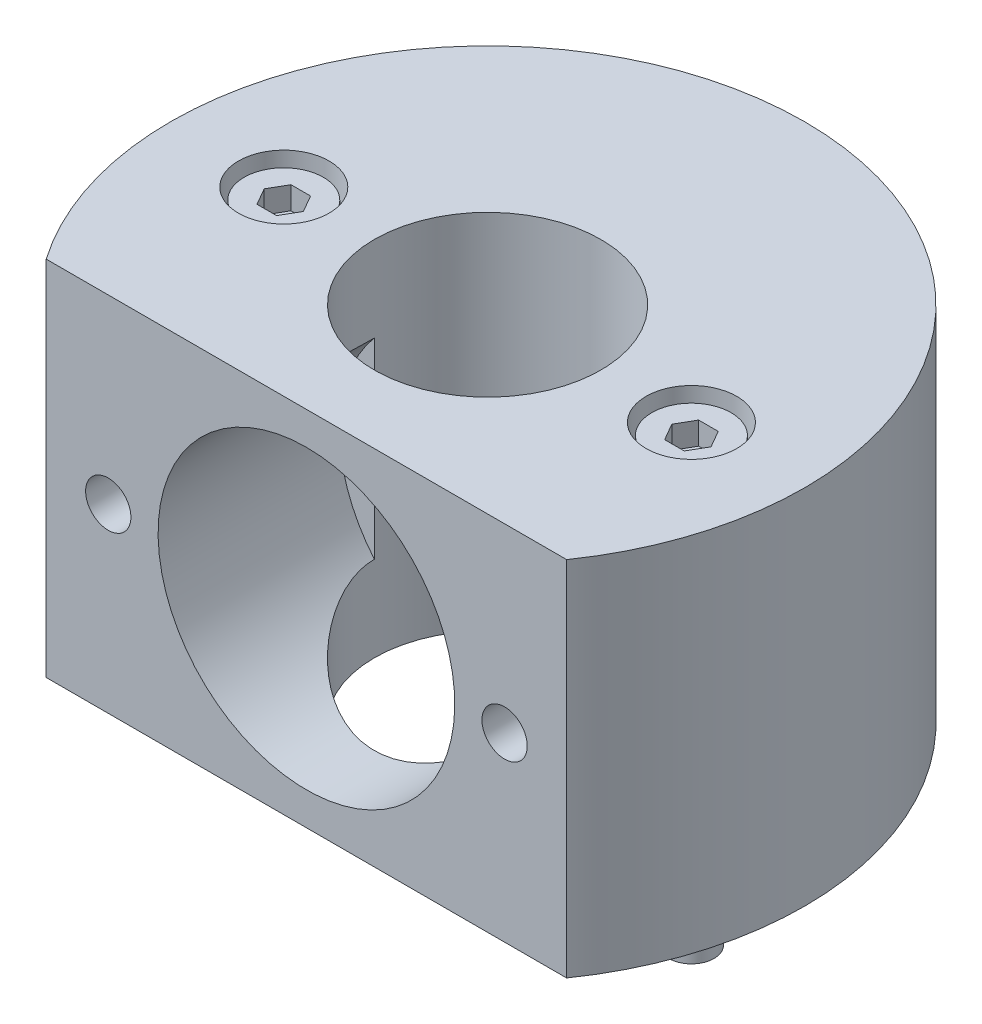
ISO-10303-21;
HEADER;
FILE_DESCRIPTION(('STEP AP214'),'2;1');
FILE_NAME('part.step','',(''),(''),'','','');
FILE_SCHEMA(('AUTOMOTIVE_DESIGN { 1 0 10303 214 1 1 1 1 }'));
ENDSEC;
DATA;
#1=APPLICATION_CONTEXT('core data for automotive mechanical design processes');
#2=APPLICATION_PROTOCOL_DEFINITION('international standard','automotive_design',2000,#1);
#3=PRODUCT_CONTEXT('',#1,'mechanical');
#4=PRODUCT('Part','Part','',(#3));
#5=PRODUCT_RELATED_PRODUCT_CATEGORY('part','',(#4));
#6=PRODUCT_DEFINITION_FORMATION('','',#4);
#7=PRODUCT_DEFINITION_CONTEXT('part definition',#1,'design');
#8=PRODUCT_DEFINITION('design','',#6,#7);
#9=PRODUCT_DEFINITION_SHAPE('','',#8);
#10=(LENGTH_UNIT() NAMED_UNIT(*) SI_UNIT(.MILLI.,.METRE.));
#11=(NAMED_UNIT(*) PLANE_ANGLE_UNIT() SI_UNIT($,.RADIAN.));
#12=(NAMED_UNIT(*) SI_UNIT($,.STERADIAN.) SOLID_ANGLE_UNIT());
#13=UNCERTAINTY_MEASURE_WITH_UNIT(LENGTH_MEASURE(1.E-05),#10,'distance_accuracy_value','');
#14=(GEOMETRIC_REPRESENTATION_CONTEXT(3) GLOBAL_UNCERTAINTY_ASSIGNED_CONTEXT((#13)) GLOBAL_UNIT_ASSIGNED_CONTEXT((#10,
#11,#12)) REPRESENTATION_CONTEXT('',''));
#15=CARTESIAN_POINT('',(0.,0.,0.));
#16=DIRECTION('',(0.,0.,1.));
#17=DIRECTION('',(1.,0.,0.));
#18=AXIS2_PLACEMENT_3D('',#15,#16,#17);
#19=CARTESIAN_POINT('',(-18.,-8.00000000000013,2.));
#20=DIRECTION('',(0.,-1.,0.));
#21=DIRECTION('',(0.,0.,-1.));
#22=AXIS2_PLACEMENT_3D('',#19,#20,#21);
#23=PLANE('',#22);
#24=CARTESIAN_POINT('',(-18.,-8.00000000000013,0.));
#25=DIRECTION('',(0.,1.,0.));
#26=DIRECTION('',(0.,0.,1.));
#27=AXIS2_PLACEMENT_3D('',#24,#25,#26);
#28=CIRCLE('',#27,2.);
#29=CARTESIAN_POINT('',(-18.,-8.00000000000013,2.));
#30=VERTEX_POINT('',#29);
#31=EDGE_CURVE('E339',#30,#30,#28,.T.);
#32=ORIENTED_EDGE('',*,*,#31,.F.);
#33=EDGE_LOOP('',(#32));
#34=FACE_BOUND('',#33,.T.);
#35=ADVANCED_FACE('F14',(#34),#23,.T.);
#36=CARTESIAN_POINT('',(-18.,11.9999999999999,0.));
#37=DIRECTION('',(0.,1.,0.));
#38=DIRECTION('',(0.,0.,1.));
#39=AXIS2_PLACEMENT_3D('',#36,#37,#38);
#40=CYLINDRICAL_SURFACE('',#39,2.);
#41=ORIENTED_EDGE('',*,*,#31,.T.);
#42=EDGE_LOOP('',(#41));
#43=FACE_BOUND('',#42,.T.);
#44=CARTESIAN_POINT('',(-18.,27.,0.));
#45=DIRECTION('',(0.,1.,0.));
#46=DIRECTION('',(0.,0.,1.));
#47=AXIS2_PLACEMENT_3D('',#44,#45,#46);
#48=CIRCLE('',#47,2.);
#49=CARTESIAN_POINT('',(-18.,27.,2.));
#50=VERTEX_POINT('',#49);
#51=EDGE_CURVE('E342',#50,#50,#48,.T.);
#52=ORIENTED_EDGE('',*,*,#51,.F.);
#53=EDGE_LOOP('',(#52));
#54=FACE_BOUND('',#53,.T.);
#55=ADVANCED_FACE('F258',(#43,#54),#40,.T.);
#56=CARTESIAN_POINT('',(-18.,27.,3.5));
#57=DIRECTION('',(0.,-1.,0.));
#58=DIRECTION('',(0.,0.,-1.));
#59=AXIS2_PLACEMENT_3D('',#56,#57,#58);
#60=PLANE('',#59);
#61=ORIENTED_EDGE('',*,*,#51,.T.);
#62=EDGE_LOOP('',(#61));
#63=FACE_BOUND('',#62,.T.);
#64=CARTESIAN_POINT('',(-18.,27.,0.));
#65=DIRECTION('',(0.,-1.,0.));
#66=DIRECTION('',(0.,0.,1.));
#67=AXIS2_PLACEMENT_3D('',#64,#65,#66);
#68=CIRCLE('',#67,2.25);
#69=CARTESIAN_POINT('',(-18.,27.,2.25));
#70=VERTEX_POINT('',#69);
#71=EDGE_CURVE('E9',#70,#70,#68,.T.);
#72=ORIENTED_EDGE('',*,*,#71,.T.);
#73=EDGE_LOOP('',(#72));
#74=FACE_BOUND('',#73,.T.);
#75=ADVANCED_FACE('F219',(#63,#74),#60,.T.);
#76=CARTESIAN_POINT('',(-16.2679491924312,29.,0.));
#77=DIRECTION('',(-0.86602540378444,0.,-0.5));
#78=DIRECTION('',(-0.5,0.,0.86602540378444));
#79=AXIS2_PLACEMENT_3D('',#76,#77,#78);
#80=PLANE('',#79);
#81=DIRECTION('',(0.,1.,0.));
#82=VECTOR('',#81,1.);
#83=CARTESIAN_POINT('',(-17.1339745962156,29.,1.5));
#84=LINE('',#83,#82);
#85=CARTESIAN_POINT('',(-17.1339745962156,29.,1.5));
#86=VERTEX_POINT('',#85);
#87=CARTESIAN_POINT('',(-17.1339745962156,31.,1.5));
#88=VERTEX_POINT('',#87);
#89=EDGE_CURVE('E337',#86,#88,#84,.T.);
#90=ORIENTED_EDGE('',*,*,#89,.T.);
#91=DIRECTION('',(-0.5,0.,0.86602540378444));
#92=VECTOR('',#91,1.);
#93=CARTESIAN_POINT('',(-16.2679491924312,31.,0.));
#94=LINE('',#93,#92);
#95=CARTESIAN_POINT('',(-16.2679491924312,31.,0.));
#96=VERTEX_POINT('',#95);
#97=EDGE_CURVE('E33',#96,#88,#94,.T.);
#98=ORIENTED_EDGE('',*,*,#97,.F.);
#99=DIRECTION('',(0.,1.,0.));
#100=VECTOR('',#99,1.);
#101=CARTESIAN_POINT('',(-16.2679491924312,29.,0.));
#102=LINE('',#101,#100);
#103=CARTESIAN_POINT('',(-16.2679491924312,29.,0.));
#104=VERTEX_POINT('',#103);
#105=EDGE_CURVE('E309',#104,#96,#102,.T.);
#106=ORIENTED_EDGE('',*,*,#105,.F.);
#107=DIRECTION('',(-0.5,0.,0.86602540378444));
#108=VECTOR('',#107,1.);
#109=CARTESIAN_POINT('',(-16.2679491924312,29.,0.));
#110=LINE('',#109,#108);
#111=EDGE_CURVE('E297',#104,#86,#110,.T.);
#112=ORIENTED_EDGE('',*,*,#111,.T.);
#113=EDGE_LOOP('',(#90,#98,#106,#112));
#114=FACE_BOUND('',#113,.T.);
#115=ADVANCED_FACE('F209',(#114),#80,.T.);
#116=CARTESIAN_POINT('',(-18.8660254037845,29.,1.5));
#117=DIRECTION('',(0.,0.,1.));
#118=DIRECTION('',(1.,0.,0.));
#119=AXIS2_PLACEMENT_3D('',#116,#117,#118);
#120=PLANE('',#119);
#121=DIRECTION('',(0.,1.,0.));
#122=VECTOR('',#121,1.);
#123=CARTESIAN_POINT('',(-18.8660254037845,29.,1.5));
#124=LINE('',#123,#122);
#125=CARTESIAN_POINT('',(-18.8660254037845,29.,1.5));
#126=VERTEX_POINT('',#125);
#127=CARTESIAN_POINT('',(-18.8660254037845,31.,1.5));
#128=VERTEX_POINT('',#127);
#129=EDGE_CURVE('E334',#126,#128,#124,.T.);
#130=ORIENTED_EDGE('',*,*,#129,.T.);
#131=DIRECTION('',(1.,0.,0.));
#132=VECTOR('',#131,1.);
#133=CARTESIAN_POINT('',(-18.8660254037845,31.,1.5));
#134=LINE('',#133,#132);
#135=EDGE_CURVE('E808',#128,#88,#134,.T.);
#136=ORIENTED_EDGE('',*,*,#135,.T.);
#137=ORIENTED_EDGE('',*,*,#89,.F.);
#138=DIRECTION('',(1.,0.,0.));
#139=VECTOR('',#138,1.);
#140=CARTESIAN_POINT('',(-18.8660254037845,29.,1.5));
#141=LINE('',#140,#139);
#142=EDGE_CURVE('E304',#126,#86,#141,.T.);
#143=ORIENTED_EDGE('',*,*,#142,.F.);
#144=EDGE_LOOP('',(#130,#136,#137,#143));
#145=FACE_BOUND('',#144,.T.);
#146=ADVANCED_FACE('F266',(#145),#120,.F.);
#147=CARTESIAN_POINT('',(-19.732050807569,29.,0.));
#148=DIRECTION('',(-0.86602540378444,0.,0.5));
#149=DIRECTION('',(0.5,0.,0.86602540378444));
#150=AXIS2_PLACEMENT_3D('',#147,#148,#149);
#151=PLANE('',#150);
#152=DIRECTION('',(0.,1.,0.));
#153=VECTOR('',#152,1.);
#154=CARTESIAN_POINT('',(-19.732050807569,29.,0.));
#155=LINE('',#154,#153);
#156=CARTESIAN_POINT('',(-19.732050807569,29.,0.));
#157=VERTEX_POINT('',#156);
#158=CARTESIAN_POINT('',(-19.732050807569,31.,0.));
#159=VERTEX_POINT('',#158);
#160=EDGE_CURVE('E331',#157,#159,#155,.T.);
#161=ORIENTED_EDGE('',*,*,#160,.T.);
#162=DIRECTION('',(0.5,0.,0.86602540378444));
#163=VECTOR('',#162,1.);
#164=CARTESIAN_POINT('',(-19.732050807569,31.,0.));
#165=LINE('',#164,#163);
#166=EDGE_CURVE('E812',#159,#128,#165,.T.);
#167=ORIENTED_EDGE('',*,*,#166,.T.);
#168=ORIENTED_EDGE('',*,*,#129,.F.);
#169=DIRECTION('',(0.5,0.,0.86602540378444));
#170=VECTOR('',#169,1.);
#171=CARTESIAN_POINT('',(-19.732050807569,29.,0.));
#172=LINE('',#171,#170);
#173=EDGE_CURVE('E324',#157,#126,#172,.T.);
#174=ORIENTED_EDGE('',*,*,#173,.F.);
#175=EDGE_LOOP('',(#161,#167,#168,#174));
#176=FACE_BOUND('',#175,.T.);
#177=ADVANCED_FACE('F269',(#176),#151,.F.);
#178=CARTESIAN_POINT('',(-19.732050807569,29.,0.));
#179=DIRECTION('',(0.86602540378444,0.,0.5));
#180=DIRECTION('',(0.5,0.,-0.86602540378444));
#181=AXIS2_PLACEMENT_3D('',#178,#179,#180);
#182=PLANE('',#181);
#183=DIRECTION('',(0.,1.,0.));
#184=VECTOR('',#183,1.);
#185=CARTESIAN_POINT('',(-18.8660254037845,29.,-1.5));
#186=LINE('',#185,#184);
#187=CARTESIAN_POINT('',(-18.8660254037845,29.,-1.5));
#188=VERTEX_POINT('',#187);
#189=CARTESIAN_POINT('',(-18.8660254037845,31.,-1.5));
#190=VERTEX_POINT('',#189);
#191=EDGE_CURVE('E328',#188,#190,#186,.T.);
#192=ORIENTED_EDGE('',*,*,#191,.T.);
#193=DIRECTION('',(0.5,0.,-0.86602540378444));
#194=VECTOR('',#193,1.);
#195=CARTESIAN_POINT('',(-19.732050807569,31.,0.));
#196=LINE('',#195,#194);
#197=EDGE_CURVE('E815',#159,#190,#196,.T.);
#198=ORIENTED_EDGE('',*,*,#197,.F.);
#199=ORIENTED_EDGE('',*,*,#160,.F.);
#200=DIRECTION('',(0.5,0.,-0.86602540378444));
#201=VECTOR('',#200,1.);
#202=CARTESIAN_POINT('',(-19.732050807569,29.,0.));
#203=LINE('',#202,#201);
#204=EDGE_CURVE('E317',#157,#188,#203,.T.);
#205=ORIENTED_EDGE('',*,*,#204,.T.);
#206=EDGE_LOOP('',(#192,#198,#199,#205));
#207=FACE_BOUND('',#206,.T.);
#208=ADVANCED_FACE('F273',(#207),#182,.T.);
#209=CARTESIAN_POINT('',(-17.1339745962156,29.,-1.5));
#210=DIRECTION('',(0.,0.,-1.));
#211=DIRECTION('',(-1.,0.,0.));
#212=AXIS2_PLACEMENT_3D('',#209,#210,#211);
#213=PLANE('',#212);
#214=DIRECTION('',(0.,1.,0.));
#215=VECTOR('',#214,1.);
#216=CARTESIAN_POINT('',(-17.1339745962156,29.,-1.5));
#217=LINE('',#216,#215);
#218=CARTESIAN_POINT('',(-17.1339745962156,29.,-1.5));
#219=VERTEX_POINT('',#218);
#220=CARTESIAN_POINT('',(-17.1339745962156,31.,-1.5));
#221=VERTEX_POINT('',#220);
#222=EDGE_CURVE('E312',#219,#221,#217,.T.);
#223=ORIENTED_EDGE('',*,*,#222,.T.);
#224=DIRECTION('',(-1.,0.,0.));
#225=VECTOR('',#224,1.);
#226=CARTESIAN_POINT('',(-17.1339745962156,31.,-1.5));
#227=LINE('',#226,#225);
#228=EDGE_CURVE('E820',#221,#190,#227,.T.);
#229=ORIENTED_EDGE('',*,*,#228,.T.);
#230=ORIENTED_EDGE('',*,*,#191,.F.);
#231=DIRECTION('',(-1.,0.,0.));
#232=VECTOR('',#231,1.);
#233=CARTESIAN_POINT('',(-17.1339745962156,29.,-1.5));
#234=LINE('',#233,#232);
#235=EDGE_CURVE('E314',#219,#188,#234,.T.);
#236=ORIENTED_EDGE('',*,*,#235,.F.);
#237=EDGE_LOOP('',(#223,#229,#230,#236));
#238=FACE_BOUND('',#237,.T.);
#239=ADVANCED_FACE('F277',(#238),#213,.F.);
#240=CARTESIAN_POINT('',(-16.2679491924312,29.,0.));
#241=DIRECTION('',(0.86602540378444,0.,-0.5));
#242=DIRECTION('',(-0.5,0.,-0.86602540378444));
#243=AXIS2_PLACEMENT_3D('',#240,#241,#242);
#244=PLANE('',#243);
#245=DIRECTION('',(-0.5,0.,-0.86602540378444));
#246=VECTOR('',#245,1.);
#247=CARTESIAN_POINT('',(-16.2679491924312,29.,0.));
#248=LINE('',#247,#246);
#249=EDGE_CURVE('E300',#104,#219,#248,.T.);
#250=ORIENTED_EDGE('',*,*,#249,.F.);
#251=ORIENTED_EDGE('',*,*,#105,.T.);
#252=DIRECTION('',(-0.5,0.,-0.86602540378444));
#253=VECTOR('',#252,1.);
#254=CARTESIAN_POINT('',(-16.2679491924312,31.,0.));
#255=LINE('',#254,#253);
#256=EDGE_CURVE('E305',#96,#221,#255,.T.);
#257=ORIENTED_EDGE('',*,*,#256,.T.);
#258=ORIENTED_EDGE('',*,*,#222,.F.);
#259=EDGE_LOOP('',(#250,#251,#257,#258));
#260=FACE_BOUND('',#259,.T.);
#261=ADVANCED_FACE('F252',(#260),#244,.F.);
#262=CARTESIAN_POINT('',(-17.1339745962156,29.,1.5));
#263=DIRECTION('',(0.,1.,0.));
#264=DIRECTION('',(0.,0.,1.));
#265=AXIS2_PLACEMENT_3D('',#262,#263,#264);
#266=PLANE('',#265);
#267=ORIENTED_EDGE('',*,*,#111,.F.);
#268=ORIENTED_EDGE('',*,*,#249,.T.);
#269=ORIENTED_EDGE('',*,*,#235,.T.);
#270=ORIENTED_EDGE('',*,*,#204,.F.);
#271=ORIENTED_EDGE('',*,*,#173,.T.);
#272=ORIENTED_EDGE('',*,*,#142,.T.);
#273=EDGE_LOOP('',(#267,#268,#269,#270,#271,#272));
#274=FACE_BOUND('',#273,.T.);
#275=ADVANCED_FACE('F250',(#274),#266,.T.);
#276=CARTESIAN_POINT('',(-18.,31.,0.));
#277=DIRECTION('',(0.,1.,0.));
#278=DIRECTION('',(0.,0.,1.));
#279=AXIS2_PLACEMENT_3D('',#276,#277,#278);
#280=PLANE('',#279);
#281=CARTESIAN_POINT('',(-18.,31.,0.));
#282=DIRECTION('',(0.,1.,0.));
#283=DIRECTION('',(0.,0.,1.));
#284=AXIS2_PLACEMENT_3D('',#281,#282,#283);
#285=CIRCLE('',#284,3.5);
#286=CARTESIAN_POINT('',(-18.,31.,3.5));
#287=VERTEX_POINT('',#286);
#288=EDGE_CURVE('E24',#287,#287,#285,.T.);
#289=ORIENTED_EDGE('',*,*,#288,.T.);
#290=EDGE_LOOP('',(#289));
#291=FACE_BOUND('',#290,.T.);
#292=ORIENTED_EDGE('',*,*,#256,.F.);
#293=ORIENTED_EDGE('',*,*,#97,.T.);
#294=ORIENTED_EDGE('',*,*,#135,.F.);
#295=ORIENTED_EDGE('',*,*,#166,.F.);
#296=ORIENTED_EDGE('',*,*,#197,.T.);
#297=ORIENTED_EDGE('',*,*,#228,.F.);
#298=EDGE_LOOP('',(#292,#293,#294,#295,#296,#297));
#299=FACE_BOUND('',#298,.T.);
#300=ADVANCED_FACE('F247',(#291,#299),#280,.T.);
#301=CARTESIAN_POINT('',(-18.,11.9999999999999,0.));
#302=DIRECTION('',(0.,1.,0.));
#303=DIRECTION('',(0.,0.,1.));
#304=AXIS2_PLACEMENT_3D('',#301,#302,#303);
#305=CYLINDRICAL_SURFACE('',#304,3.5);
#306=CARTESIAN_POINT('',(-18.,27.,0.));
#307=DIRECTION('',(0.,1.,0.));
#308=DIRECTION('',(0.,0.,1.));
#309=AXIS2_PLACEMENT_3D('',#306,#307,#308);
#310=CIRCLE('',#309,3.5);
#311=CARTESIAN_POINT('',(-18.,27.,3.5));
#312=VERTEX_POINT('',#311);
#313=EDGE_CURVE('E345',#312,#312,#310,.T.);
#314=ORIENTED_EDGE('',*,*,#313,.T.);
#315=EDGE_LOOP('',(#314));
#316=FACE_BOUND('',#315,.T.);
#317=ORIENTED_EDGE('',*,*,#288,.F.);
#318=EDGE_LOOP('',(#317));
#319=FACE_BOUND('',#318,.T.);
#320=ADVANCED_FACE('F245',(#316,#319),#305,.T.);
#321=CARTESIAN_POINT('',(18.8660254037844,29.,1.5));
#322=DIRECTION('',(0.,1.,0.));
#323=DIRECTION('',(0.,0.,1.));
#324=AXIS2_PLACEMENT_3D('',#321,#322,#323);
#325=PLANE('',#324);
#326=DIRECTION('',(-0.5,0.,0.86602540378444));
#327=VECTOR('',#326,1.);
#328=CARTESIAN_POINT('',(19.7320508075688,29.,0.));
#329=LINE('',#328,#327);
#330=CARTESIAN_POINT('',(19.7320508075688,29.,0.));
#331=VERTEX_POINT('',#330);
#332=CARTESIAN_POINT('',(18.8660254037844,29.,1.5));
#333=VERTEX_POINT('',#332);
#334=EDGE_CURVE('E353',#331,#333,#329,.T.);
#335=ORIENTED_EDGE('',*,*,#334,.F.);
#336=DIRECTION('',(-0.5,0.,-0.86602540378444));
#337=VECTOR('',#336,1.);
#338=CARTESIAN_POINT('',(19.7320508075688,29.,0.));
#339=LINE('',#338,#337);
#340=CARTESIAN_POINT('',(18.8660254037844,29.,-1.5));
#341=VERTEX_POINT('',#340);
#342=EDGE_CURVE('E369',#331,#341,#339,.T.);
#343=ORIENTED_EDGE('',*,*,#342,.T.);
#344=DIRECTION('',(-1.,0.,0.));
#345=VECTOR('',#344,1.);
#346=CARTESIAN_POINT('',(18.8660254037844,29.,-1.5));
#347=LINE('',#346,#345);
#348=CARTESIAN_POINT('',(17.1339745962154,29.,-1.5));
#349=VERTEX_POINT('',#348);
#350=EDGE_CURVE('E373',#341,#349,#347,.T.);
#351=ORIENTED_EDGE('',*,*,#350,.T.);
#352=DIRECTION('',(0.5,0.,-0.86602540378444));
#353=VECTOR('',#352,1.);
#354=CARTESIAN_POINT('',(16.267949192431,29.,0.));
#355=LINE('',#354,#353);
#356=CARTESIAN_POINT('',(16.267949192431,29.,0.));
#357=VERTEX_POINT('',#356);
#358=EDGE_CURVE('E376',#357,#349,#355,.T.);
#359=ORIENTED_EDGE('',*,*,#358,.F.);
#360=DIRECTION('',(0.5,0.,0.86602540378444));
#361=VECTOR('',#360,1.);
#362=CARTESIAN_POINT('',(16.267949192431,29.,0.));
#363=LINE('',#362,#361);
#364=CARTESIAN_POINT('',(17.1339745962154,29.,1.5));
#365=VERTEX_POINT('',#364);
#366=EDGE_CURVE('E379',#357,#365,#363,.T.);
#367=ORIENTED_EDGE('',*,*,#366,.T.);
#368=DIRECTION('',(1.,0.,0.));
#369=VECTOR('',#368,1.);
#370=CARTESIAN_POINT('',(17.1339745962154,29.,1.5));
#371=LINE('',#370,#369);
#372=EDGE_CURVE('E382',#365,#333,#371,.T.);
#373=ORIENTED_EDGE('',*,*,#372,.T.);
#374=EDGE_LOOP('',(#335,#343,#351,#359,#367,#373));
#375=FACE_BOUND('',#374,.T.);
#376=ADVANCED_FACE('F235',(#375),#325,.T.);
#377=CARTESIAN_POINT('',(18.8660254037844,29.,-1.5));
#378=DIRECTION('',(0.,0.,-1.));
#379=DIRECTION('',(-1.,0.,0.));
#380=AXIS2_PLACEMENT_3D('',#377,#378,#379);
#381=PLANE('',#380);
#382=DIRECTION('',(0.,1.,0.));
#383=VECTOR('',#382,1.);
#384=CARTESIAN_POINT('',(18.8660254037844,29.,-1.5));
#385=LINE('',#384,#383);
#386=CARTESIAN_POINT('',(18.8660254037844,31.,-1.5));
#387=VERTEX_POINT('',#386);
#388=EDGE_CURVE('E389',#341,#387,#385,.T.);
#389=ORIENTED_EDGE('',*,*,#388,.T.);
#390=DIRECTION('',(-1.,0.,0.));
#391=VECTOR('',#390,1.);
#392=CARTESIAN_POINT('',(18.8660254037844,31.,-1.5));
#393=LINE('',#392,#391);
#394=CARTESIAN_POINT('',(17.1339745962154,31.,-1.5));
#395=VERTEX_POINT('',#394);
#396=EDGE_CURVE('E354',#387,#395,#393,.T.);
#397=ORIENTED_EDGE('',*,*,#396,.T.);
#398=DIRECTION('',(0.,1.,0.));
#399=VECTOR('',#398,1.);
#400=CARTESIAN_POINT('',(17.1339745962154,29.,-1.5));
#401=LINE('',#400,#399);
#402=EDGE_CURVE('E391',#349,#395,#401,.T.);
#403=ORIENTED_EDGE('',*,*,#402,.F.);
#404=ORIENTED_EDGE('',*,*,#350,.F.);
#405=EDGE_LOOP('',(#389,#397,#403,#404));
#406=FACE_BOUND('',#405,.T.);
#407=ADVANCED_FACE('F231',(#406),#381,.F.);
#408=CARTESIAN_POINT('',(16.267949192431,29.,0.));
#409=DIRECTION('',(0.86602540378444,0.,0.5));
#410=DIRECTION('',(0.5,0.,-0.86602540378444));
#411=AXIS2_PLACEMENT_3D('',#408,#409,#410);
#412=PLANE('',#411);
#413=ORIENTED_EDGE('',*,*,#402,.T.);
#414=DIRECTION('',(0.5,0.,-0.86602540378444));
#415=VECTOR('',#414,1.);
#416=CARTESIAN_POINT('',(16.267949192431,31.,0.));
#417=LINE('',#416,#415);
#418=CARTESIAN_POINT('',(16.267949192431,31.,0.));
#419=VERTEX_POINT('',#418);
#420=EDGE_CURVE('E357',#419,#395,#417,.T.);
#421=ORIENTED_EDGE('',*,*,#420,.F.);
#422=DIRECTION('',(0.,1.,0.));
#423=VECTOR('',#422,1.);
#424=CARTESIAN_POINT('',(16.267949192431,29.,0.));
#425=LINE('',#424,#423);
#426=EDGE_CURVE('E393',#357,#419,#425,.T.);
#427=ORIENTED_EDGE('',*,*,#426,.F.);
#428=ORIENTED_EDGE('',*,*,#358,.T.);
#429=EDGE_LOOP('',(#413,#421,#427,#428));
#430=FACE_BOUND('',#429,.T.);
#431=ADVANCED_FACE('F227',(#430),#412,.T.);
#432=CARTESIAN_POINT('',(16.267949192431,29.,0.));
#433=DIRECTION('',(-0.86602540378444,0.,0.5));
#434=DIRECTION('',(0.5,0.,0.86602540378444));
#435=AXIS2_PLACEMENT_3D('',#432,#433,#434);
#436=PLANE('',#435);
#437=ORIENTED_EDGE('',*,*,#426,.T.);
#438=DIRECTION('',(0.5,0.,0.86602540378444));
#439=VECTOR('',#438,1.);
#440=CARTESIAN_POINT('',(16.267949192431,31.,0.));
#441=LINE('',#440,#439);
#442=CARTESIAN_POINT('',(17.1339745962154,31.,1.5));
#443=VERTEX_POINT('',#442);
#444=EDGE_CURVE('E360',#419,#443,#441,.T.);
#445=ORIENTED_EDGE('',*,*,#444,.T.);
#446=DIRECTION('',(0.,1.,0.));
#447=VECTOR('',#446,1.);
#448=CARTESIAN_POINT('',(17.1339745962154,29.,1.5));
#449=LINE('',#448,#447);
#450=EDGE_CURVE('E395',#365,#443,#449,.T.);
#451=ORIENTED_EDGE('',*,*,#450,.F.);
#452=ORIENTED_EDGE('',*,*,#366,.F.);
#453=EDGE_LOOP('',(#437,#445,#451,#452));
#454=FACE_BOUND('',#453,.T.);
#455=ADVANCED_FACE('F223',(#454),#436,.F.);
#456=CARTESIAN_POINT('',(17.1339745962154,29.,1.5));
#457=DIRECTION('',(0.,0.,1.));
#458=DIRECTION('',(1.,0.,0.));
#459=AXIS2_PLACEMENT_3D('',#456,#457,#458);
#460=PLANE('',#459);
#461=ORIENTED_EDGE('',*,*,#450,.T.);
#462=DIRECTION('',(1.,0.,0.));
#463=VECTOR('',#462,1.);
#464=CARTESIAN_POINT('',(17.1339745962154,31.,1.5));
#465=LINE('',#464,#463);
#466=CARTESIAN_POINT('',(18.8660254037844,31.,1.5));
#467=VERTEX_POINT('',#466);
#468=EDGE_CURVE('E363',#443,#467,#465,.T.);
#469=ORIENTED_EDGE('',*,*,#468,.T.);
#470=DIRECTION('',(0.,1.,0.));
#471=VECTOR('',#470,1.);
#472=CARTESIAN_POINT('',(18.8660254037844,29.,1.5));
#473=LINE('',#472,#471);
#474=EDGE_CURVE('E397',#333,#467,#473,.T.);
#475=ORIENTED_EDGE('',*,*,#474,.F.);
#476=ORIENTED_EDGE('',*,*,#372,.F.);
#477=EDGE_LOOP('',(#461,#469,#475,#476));
#478=FACE_BOUND('',#477,.T.);
#479=ADVANCED_FACE('F220',(#478),#460,.F.);
#480=CARTESIAN_POINT('',(19.7320508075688,29.,0.));
#481=DIRECTION('',(-0.86602540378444,0.,-0.5));
#482=DIRECTION('',(-0.5,0.,0.86602540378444));
#483=AXIS2_PLACEMENT_3D('',#480,#481,#482);
#484=PLANE('',#483);
#485=ORIENTED_EDGE('',*,*,#474,.T.);
#486=DIRECTION('',(-0.5,0.,0.86602540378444));
#487=VECTOR('',#486,1.);
#488=CARTESIAN_POINT('',(19.7320508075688,31.,0.));
#489=LINE('',#488,#487);
#490=CARTESIAN_POINT('',(19.7320508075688,31.,0.));
#491=VERTEX_POINT('',#490);
#492=EDGE_CURVE('E366',#491,#467,#489,.T.);
#493=ORIENTED_EDGE('',*,*,#492,.F.);
#494=DIRECTION('',(0.,1.,0.));
#495=VECTOR('',#494,1.);
#496=CARTESIAN_POINT('',(19.7320508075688,29.,0.));
#497=LINE('',#496,#495);
#498=EDGE_CURVE('E372',#331,#491,#497,.T.);
#499=ORIENTED_EDGE('',*,*,#498,.F.);
#500=ORIENTED_EDGE('',*,*,#334,.T.);
#501=EDGE_LOOP('',(#485,#493,#499,#500));
#502=FACE_BOUND('',#501,.T.);
#503=ADVANCED_FACE('F199',(#502),#484,.T.);
#504=CARTESIAN_POINT('',(19.7320508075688,29.,0.));
#505=DIRECTION('',(0.86602540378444,0.,-0.5));
#506=DIRECTION('',(-0.5,0.,-0.86602540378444));
#507=AXIS2_PLACEMENT_3D('',#504,#505,#506);
#508=PLANE('',#507);
#509=ORIENTED_EDGE('',*,*,#342,.F.);
#510=ORIENTED_EDGE('',*,*,#498,.T.);
#511=DIRECTION('',(-0.5,0.,-0.86602540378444));
#512=VECTOR('',#511,1.);
#513=CARTESIAN_POINT('',(19.7320508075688,31.,0.));
#514=LINE('',#513,#512);
#515=EDGE_CURVE('E350',#491,#387,#514,.T.);
#516=ORIENTED_EDGE('',*,*,#515,.T.);
#517=ORIENTED_EDGE('',*,*,#388,.F.);
#518=EDGE_LOOP('',(#509,#510,#516,#517));
#519=FACE_BOUND('',#518,.T.);
#520=ADVANCED_FACE('F204',(#519),#508,.F.);
#521=CARTESIAN_POINT('',(18.,31.,0.));
#522=DIRECTION('',(0.,1.,0.));
#523=DIRECTION('',(0.,0.,1.));
#524=AXIS2_PLACEMENT_3D('',#521,#522,#523);
#525=PLANE('',#524);
#526=CARTESIAN_POINT('',(18.,31.,0.));
#527=DIRECTION('',(0.,1.,0.));
#528=DIRECTION('',(0.,0.,1.));
#529=AXIS2_PLACEMENT_3D('',#526,#527,#528);
#530=CIRCLE('',#529,3.5);
#531=CARTESIAN_POINT('',(18.,31.,3.5));
#532=VERTEX_POINT('',#531);
#533=EDGE_CURVE('E408',#532,#532,#530,.T.);
#534=ORIENTED_EDGE('',*,*,#533,.T.);
#535=EDGE_LOOP('',(#534));
#536=FACE_BOUND('',#535,.T.);
#537=ORIENTED_EDGE('',*,*,#515,.F.);
#538=ORIENTED_EDGE('',*,*,#492,.T.);
#539=ORIENTED_EDGE('',*,*,#468,.F.);
#540=ORIENTED_EDGE('',*,*,#444,.F.);
#541=ORIENTED_EDGE('',*,*,#420,.T.);
#542=ORIENTED_EDGE('',*,*,#396,.F.);
#543=EDGE_LOOP('',(#537,#538,#539,#540,#541,#542));
#544=FACE_BOUND('',#543,.T.);
#545=ADVANCED_FACE('F200',(#536,#544),#525,.T.);
#546=CARTESIAN_POINT('',(18.,12.0000000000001,0.));
#547=DIRECTION('',(0.,1.,0.));
#548=DIRECTION('',(0.,0.,1.));
#549=AXIS2_PLACEMENT_3D('',#546,#547,#548);
#550=CYLINDRICAL_SURFACE('',#549,3.5);
#551=CARTESIAN_POINT('',(18.,27.,0.));
#552=DIRECTION('',(0.,1.,0.));
#553=DIRECTION('',(0.,0.,1.));
#554=AXIS2_PLACEMENT_3D('',#551,#552,#553);
#555=CIRCLE('',#554,3.5);
#556=CARTESIAN_POINT('',(18.,27.,3.5));
#557=VERTEX_POINT('',#556);
#558=EDGE_CURVE('E405',#557,#557,#555,.T.);
#559=ORIENTED_EDGE('',*,*,#558,.T.);
#560=EDGE_LOOP('',(#559));
#561=FACE_BOUND('',#560,.T.);
#562=ORIENTED_EDGE('',*,*,#533,.F.);
#563=EDGE_LOOP('',(#562));
#564=FACE_BOUND('',#563,.T.);
#565=ADVANCED_FACE('F203',(#561,#564),#550,.T.);
#566=CARTESIAN_POINT('',(18.,-7.99999999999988,2.));
#567=DIRECTION('',(0.,-1.,0.));
#568=DIRECTION('',(0.,0.,-1.));
#569=AXIS2_PLACEMENT_3D('',#566,#567,#568);
#570=PLANE('',#569);
#571=CARTESIAN_POINT('',(18.,-7.99999999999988,0.));
#572=DIRECTION('',(0.,1.,0.));
#573=DIRECTION('',(0.,0.,1.));
#574=AXIS2_PLACEMENT_3D('',#571,#572,#573);
#575=CIRCLE('',#574,2.);
#576=CARTESIAN_POINT('',(18.,-7.99999999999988,2.));
#577=VERTEX_POINT('',#576);
#578=EDGE_CURVE('E399',#577,#577,#575,.T.);
#579=ORIENTED_EDGE('',*,*,#578,.F.);
#580=EDGE_LOOP('',(#579));
#581=FACE_BOUND('',#580,.T.);
#582=ADVANCED_FACE('F165',(#581),#570,.T.);
#583=CARTESIAN_POINT('',(15.75,27.,0.));
#584=DIRECTION('',(0.,-1.,0.));
#585=DIRECTION('',(1.,0.,0.));
#586=AXIS2_PLACEMENT_3D('',#583,#584,#585);
#587=PLANE('',#586);
#588=ORIENTED_EDGE('',*,*,#558,.F.);
#589=EDGE_LOOP('',(#588));
#590=FACE_BOUND('',#589,.T.);
#591=CARTESIAN_POINT('',(18.,27.,0.));
#592=DIRECTION('',(0.,1.,0.));
#593=DIRECTION('',(-1.,0.,0.));
#594=AXIS2_PLACEMENT_3D('',#591,#592,#593);
#595=CIRCLE('',#594,4.);
#596=CARTESIAN_POINT('',(14.,27.,0.));
#597=VERTEX_POINT('',#596);
#598=EDGE_CURVE('E438',#597,#597,#595,.T.);
#599=ORIENTED_EDGE('',*,*,#598,.T.);
#600=EDGE_LOOP('',(#599));
#601=FACE_BOUND('',#600,.T.);
#602=ADVANCED_FACE('F161',(#590,#601),#587,.F.);
#603=CARTESIAN_POINT('',(17.5,16.,8.));
#604=DIRECTION('',(0.,0.,-1.));
#605=DIRECTION('',(0.,-1.,0.));
#606=AXIS2_PLACEMENT_3D('',#603,#604,#605);
#607=PLANE('',#606);
#608=CARTESIAN_POINT('',(17.5,16.,8.));
#609=DIRECTION('',(0.,0.,1.));
#610=DIRECTION('',(0.,1.,0.));
#611=AXIS2_PLACEMENT_3D('',#608,#609,#610);
#612=CIRCLE('',#611,2.);
#613=CARTESIAN_POINT('',(17.5,18.,8.));
#614=VERTEX_POINT('',#613);
#615=EDGE_CURVE('E423',#614,#614,#612,.T.);
#616=ORIENTED_EDGE('',*,*,#615,.T.);
#617=EDGE_LOOP('',(#616));
#618=FACE_BOUND('',#617,.T.);
#619=ADVANCED_FACE('F164',(#618),#607,.F.);
#620=CARTESIAN_POINT('',(-17.5,16.,8.));
#621=DIRECTION('',(0.,0.,-1.));
#622=DIRECTION('',(0.,-1.,0.));
#623=AXIS2_PLACEMENT_3D('',#620,#621,#622);
#624=PLANE('',#623);
#625=CARTESIAN_POINT('',(-17.5,16.,8.));
#626=DIRECTION('',(0.,0.,1.));
#627=DIRECTION('',(0.,1.,0.));
#628=AXIS2_PLACEMENT_3D('',#625,#626,#627);
#629=CIRCLE('',#628,2.);
#630=CARTESIAN_POINT('',(-17.5,18.,8.));
#631=VERTEX_POINT('',#630);
#632=EDGE_CURVE('E417',#631,#631,#629,.T.);
#633=ORIENTED_EDGE('',*,*,#632,.T.);
#634=EDGE_LOOP('',(#633));
#635=FACE_BOUND('',#634,.T.);
#636=ADVANCED_FACE('F187',(#635),#624,.F.);
#637=CARTESIAN_POINT('',(18.,12.0000000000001,0.));
#638=DIRECTION('',(0.,1.,0.));
#639=DIRECTION('',(0.,0.,1.));
#640=AXIS2_PLACEMENT_3D('',#637,#638,#639);
#641=CYLINDRICAL_SURFACE('',#640,2.);
#642=ORIENTED_EDGE('',*,*,#578,.T.);
#643=EDGE_LOOP('',(#642));
#644=FACE_BOUND('',#643,.T.);
#645=CARTESIAN_POINT('',(18.,27.,0.));
#646=DIRECTION('',(0.,1.,0.));
#647=DIRECTION('',(0.,0.,1.));
#648=AXIS2_PLACEMENT_3D('',#645,#646,#647);
#649=CIRCLE('',#648,2.);
#650=CARTESIAN_POINT('',(18.,27.,2.));
#651=VERTEX_POINT('',#650);
#652=EDGE_CURVE('E402',#651,#651,#649,.T.);
#653=ORIENTED_EDGE('',*,*,#652,.F.);
#654=EDGE_LOOP('',(#653));
#655=FACE_BOUND('',#654,.T.);
#656=ADVANCED_FACE('F169',(#644,#655),#641,.T.);
#657=CARTESIAN_POINT('',(18.,32.,0.));
#658=DIRECTION('',(0.,1.,0.));
#659=DIRECTION('',(-1.,0.,0.));
#660=AXIS2_PLACEMENT_3D('',#657,#658,#659);
#661=CYLINDRICAL_SURFACE('',#660,4.);
#662=ORIENTED_EDGE('',*,*,#598,.F.);
#663=EDGE_LOOP('',(#662));
#664=FACE_BOUND('',#663,.T.);
#665=CARTESIAN_POINT('',(18.,32.,0.));
#666=DIRECTION('',(0.,1.,0.));
#667=DIRECTION('',(-1.,0.,0.));
#668=AXIS2_PLACEMENT_3D('',#665,#666,#667);
#669=CIRCLE('',#668,4.);
#670=CARTESIAN_POINT('',(14.,32.,0.));
#671=VERTEX_POINT('',#670);
#672=EDGE_CURVE('E435',#671,#671,#669,.T.);
#673=ORIENTED_EDGE('',*,*,#672,.T.);
#674=EDGE_LOOP('',(#673));
#675=FACE_BOUND('',#674,.T.);
#676=ADVANCED_FACE('F155',(#664,#675),#661,.F.);
#677=CARTESIAN_POINT('',(0.,16.,0.));
#678=DIRECTION('',(0.,0.,1.));
#679=DIRECTION('',(0.,1.,0.));
#680=AXIS2_PLACEMENT_3D('',#677,#678,#679);
#681=PLANE('',#680);
#682=CARTESIAN_POINT('',(0.,16.,0.));
#683=DIRECTION('',(0.,0.,1.));
#684=DIRECTION('',(0.,1.,0.));
#685=AXIS2_PLACEMENT_3D('',#682,#683,#684);
#686=CIRCLE('',#685,13.1);
#687=CARTESIAN_POINT('',(10.,7.53773080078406,0.));
#688=VERTEX_POINT('',#687);
#689=CARTESIAN_POINT('',(10.,24.4622691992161,0.));
#690=VERTEX_POINT('',#689);
#691=EDGE_CURVE('E448',#688,#690,#686,.T.);
#692=ORIENTED_EDGE('',*,*,#691,.T.);
#693=DIRECTION('',(0.,-1.,0.));
#694=VECTOR('',#693,1.);
#695=CARTESIAN_POINT('',(9.99999999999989,32.,0.));
#696=LINE('',#695,#694);
#697=EDGE_CURVE('E126',#688,#690,#696,.F.);
#698=ORIENTED_EDGE('',*,*,#697,.F.);
#699=EDGE_LOOP('',(#692,#698));
#700=FACE_BOUND('',#699,.T.);
#701=ADVANCED_FACE('F151',(#700),#681,.T.);
#702=CARTESIAN_POINT('',(-10.,24.4622691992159,0.));
#703=VERTEX_POINT('',#702);
#704=CARTESIAN_POINT('',(-10.,7.53773080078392,0.));
#705=VERTEX_POINT('',#704);
#706=EDGE_CURVE('E445',#703,#705,#686,.T.);
#707=ORIENTED_EDGE('',*,*,#706,.T.);
#708=DIRECTION('',(0.,-1.,0.));
#709=VECTOR('',#708,1.);
#710=CARTESIAN_POINT('',(-10.,32.,0.));
#711=LINE('',#710,#709);
#712=EDGE_CURVE('E18',#703,#705,#711,.T.);
#713=ORIENTED_EDGE('',*,*,#712,.F.);
#714=EDGE_LOOP('',(#707,#713));
#715=FACE_BOUND('',#714,.T.);
#716=ADVANCED_FACE('F149',(#715),#681,.T.);
#717=CARTESIAN_POINT('',(0.,16.,0.));
#718=DIRECTION('',(0.,0.,1.));
#719=DIRECTION('',(0.,1.,0.));
#720=AXIS2_PLACEMENT_3D('',#717,#718,#719);
#721=CYLINDRICAL_SURFACE('',#720,13.1);
#722=CARTESIAN_POINT('',(-10.,24.4622691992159,0.));
#723=CARTESIAN_POINT('',(-10.0000029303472,24.4622598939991,0.1170103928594));
#724=CARTESIAN_POINT('',(-9.99794556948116,24.4646975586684,0.233996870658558));
#725=CARTESIAN_POINT('',(-9.98974447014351,24.4743769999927,0.467606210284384));
#726=CARTESIAN_POINT('',(-9.98360149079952,24.4816178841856,0.584229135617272));
#727=CARTESIAN_POINT('',(-9.95913755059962,24.5103611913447,0.932527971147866));
#728=CARTESIAN_POINT('',(-9.93478118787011,24.5388852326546,1.16325704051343));
#729=CARTESIAN_POINT('',(-9.87110884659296,24.61240397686,1.61644236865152));
#730=CARTESIAN_POINT('',(-9.83201005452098,24.657159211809,1.83896956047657));
#731=CARTESIAN_POINT('',(-9.73970988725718,24.7608710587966,2.27779841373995));
#732=CARTESIAN_POINT('',(-9.68649946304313,24.8198367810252,2.49409598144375));
#733=CARTESIAN_POINT('',(-9.55393104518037,24.9634753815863,2.96558713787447));
#734=CARTESIAN_POINT('',(-9.47140437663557,25.0509500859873,3.2190309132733));
#735=CARTESIAN_POINT('',(-9.28834668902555,25.2387120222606,3.71434777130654));
#736=CARTESIAN_POINT('',(-9.1878120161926,25.3390018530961,3.95621849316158));
#737=CARTESIAN_POINT('',(-8.96927279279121,25.5490968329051,4.42949992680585));
#738=CARTESIAN_POINT('',(-8.85117233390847,25.6589527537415,4.66084348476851));
#739=CARTESIAN_POINT('',(-8.59876393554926,25.8843254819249,5.11155254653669));
#740=CARTESIAN_POINT('',(-8.46445715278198,25.9998418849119,5.33091890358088));
#741=CARTESIAN_POINT('',(-8.17697751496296,26.2363304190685,5.76244331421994));
#742=CARTESIAN_POINT('',(-8.02344849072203,26.3573668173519,5.97432855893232));
#743=CARTESIAN_POINT('',(-7.70037984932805,26.5997613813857,6.38533253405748));
#744=CARTESIAN_POINT('',(-7.53083974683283,26.7211195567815,6.58445087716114));
#745=CARTESIAN_POINT('',(-7.176351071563,26.9615587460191,6.96909251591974));
#746=CARTESIAN_POINT('',(-6.99143284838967,27.0806437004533,7.1546412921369));
#747=CARTESIAN_POINT('',(-6.60606728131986,27.3146234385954,7.51191898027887));
#748=CARTESIAN_POINT('',(-6.40561495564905,27.429516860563,7.68364342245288));
#749=CARTESIAN_POINT('',(-5.99822991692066,27.6482804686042,8.00535768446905));
#750=CARTESIAN_POINT('',(-5.79191824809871,27.7524106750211,8.15595594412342));
#751=CARTESIAN_POINT('',(-5.36584670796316,27.9529533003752,8.44236569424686));
#752=CARTESIAN_POINT('',(-5.14609317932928,28.0493693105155,8.57818407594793));
#753=CARTESIAN_POINT('',(-4.69372626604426,28.2326807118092,8.83382193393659));
#754=CARTESIAN_POINT('',(-4.46111582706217,28.3195782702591,8.95364505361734));
#755=CARTESIAN_POINT('',(-3.98393951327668,28.4820555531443,9.17591755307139));
#756=CARTESIAN_POINT('',(-3.73937562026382,28.5576371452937,9.27836980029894));
#757=CARTESIAN_POINT('',(-3.27688802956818,28.6854516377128,9.45058158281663));
#758=CARTESIAN_POINT('',(-3.06042670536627,28.739485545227,9.5229378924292));
#759=CARTESIAN_POINT('',(-2.62090357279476,28.8371148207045,9.65315363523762));
#760=CARTESIAN_POINT('',(-2.39784291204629,28.8807119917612,9.71101557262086));
#761=CARTESIAN_POINT('',(-1.94651807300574,28.9565968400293,9.81144655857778));
#762=CARTESIAN_POINT('',(-1.71825644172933,28.9888899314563,9.85402292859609));
#763=CARTESIAN_POINT('',(-1.25795909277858,29.0415180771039,9.92329087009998));
#764=CARTESIAN_POINT('',(-1.02592333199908,29.0618529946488,9.94998226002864));
#765=CARTESIAN_POINT('',(-0.55913836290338,29.0901561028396,9.98710829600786));
#766=CARTESIAN_POINT('',(-0.324383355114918,29.0980893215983,9.99749696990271));
#767=CARTESIAN_POINT('',(0.145362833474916,29.101299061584,10.001701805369));
#768=CARTESIAN_POINT('',(0.380354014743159,29.0965755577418,9.99551793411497));
#769=CARTESIAN_POINT('',(0.848756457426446,29.0745781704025,9.96667852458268));
#770=CARTESIAN_POINT('',(1.08216751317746,29.057302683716,9.94402088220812));
#771=CARTESIAN_POINT('',(1.54561552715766,29.0105847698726,9.88259648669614));
#772=CARTESIAN_POINT('',(1.77565252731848,28.9811424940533,9.84382993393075));
#773=CARTESIAN_POINT('',(2.22133852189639,28.9121800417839,9.75270429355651));
#774=CARTESIAN_POINT('',(2.43718923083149,28.8731266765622,9.7009732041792));
#775=CARTESIAN_POINT('',(2.86317337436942,28.7851304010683,9.58389537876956));
#776=CARTESIAN_POINT('',(3.07330480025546,28.7361840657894,9.51854392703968));
#777=CARTESIAN_POINT('',(3.4867048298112,28.6292702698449,9.37500718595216));
#778=CARTESIAN_POINT('',(3.68997495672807,28.5713048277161,9.29682476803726));
#779=CARTESIAN_POINT('',(4.08895887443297,28.4472520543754,9.12838048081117));
#780=CARTESIAN_POINT('',(4.28466988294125,28.3811617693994,9.03811421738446));
#781=CARTESIAN_POINT('',(4.68806198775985,28.2344947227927,8.83618559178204));
#782=CARTESIAN_POINT('',(4.89482757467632,28.1531252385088,8.72327062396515));
#783=CARTESIAN_POINT('',(5.29773469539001,27.9829820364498,8.48462507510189));
#784=CARTESIAN_POINT('',(5.4938717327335,27.894205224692,8.35888913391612));
#785=CARTESIAN_POINT('',(5.87507124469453,27.7106064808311,8.09550649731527));
#786=CARTESIAN_POINT('',(6.06013074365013,27.61578293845,7.95785662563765));
#787=CARTESIAN_POINT('',(6.41885564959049,27.4214673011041,7.67143953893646));
#788=CARTESIAN_POINT('',(6.59251962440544,27.321974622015,7.52267093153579));
#789=CARTESIAN_POINT('',(6.9618070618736,27.0994828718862,7.18386855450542));
#790=CARTESIAN_POINT('',(7.15488407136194,26.9757594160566,6.99152934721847));
#791=CARTESIAN_POINT('',(7.52409930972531,26.7260250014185,6.59255865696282));
#792=CARTESIAN_POINT('',(7.70023436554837,26.6000136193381,6.38592450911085));
#793=CARTESIAN_POINT('',(8.03548167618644,26.3481901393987,5.95859819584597));
#794=CARTESIAN_POINT('',(8.19456988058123,26.2223785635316,5.73788685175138));
#795=CARTESIAN_POINT('',(8.49499179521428,25.9741194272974,5.28293576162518));
#796=CARTESIAN_POINT('',(8.63632896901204,25.8516712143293,5.04869866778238));
#797=CARTESIAN_POINT('',(8.8771606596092,25.6347000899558,4.60946148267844));
#798=CARTESIAN_POINT('',(8.97963165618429,25.5390738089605,4.40663608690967));
#799=CARTESIAN_POINT('',(9.1715512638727,25.3546965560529,3.99184940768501));
#800=CARTESIAN_POINT('',(9.26099973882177,25.2659456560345,3.77988802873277));
#801=CARTESIAN_POINT('',(9.42569166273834,25.0983557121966,3.3480545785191));
#802=CARTESIAN_POINT('',(9.50100369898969,25.0194694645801,3.12822720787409));
#803=CARTESIAN_POINT('',(9.63700038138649,24.8740153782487,2.68011161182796));
#804=CARTESIAN_POINT('',(9.69768903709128,24.8074441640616,2.45182572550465));
#805=CARTESIAN_POINT('',(9.79092185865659,24.7035348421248,2.04230050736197));
#806=CARTESIAN_POINT('',(9.82672845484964,24.663003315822,1.86261133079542));
#807=CARTESIAN_POINT('',(9.88863409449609,24.5922706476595,1.49960215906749));
#808=CARTESIAN_POINT('',(9.91473675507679,24.5620656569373,1.31628354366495));
#809=CARTESIAN_POINT('',(9.95701673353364,24.5128696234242,0.945002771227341));
#810=CARTESIAN_POINT('',(9.97308674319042,24.4939998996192,0.75701205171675));
#811=CARTESIAN_POINT('',(9.99460331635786,24.4686459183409,0.379365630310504));
#812=CARTESIAN_POINT('',(10.0000366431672,24.4621770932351,0.189708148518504));
#813=CARTESIAN_POINT('',(10.,24.4622691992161,0.));
#814=B_SPLINE_CURVE_WITH_KNOTS('',3,(#722,#723,#724,#725,#726,#727,#728,#729,#730,#731,#732,
#733,#734,#735,#736,#737,#738,#739,#740,#741,#742,#743,#744,#745,#746,#747,#748,#749,#750,#751,
#752,#753,#754,#755,#756,#757,#758,#759,#760,#761,#762,#763,#764,#765,#766,#767,#768,#769,#770,
#771,#772,#773,#774,#775,#776,#777,#778,#779,#780,#781,#782,#783,#784,#785,#786,#787,#788,#789,
#790,#791,#792,#793,#794,#795,#796,#797,#798,#799,#800,#801,#802,#803,#804,#805,#806,#807,#808,
#809,#810,#811,#812,#813),.UNSPECIFIED.,.F.,.F.,(4,2,2,2,2,2,2,2,2,2,2,2,2,2,2,2,2,2,2,2,2,2,2,
2,2,2,2,2,2,2,2,2,2,2,2,2,2,2,2,2,2,2,2,2,2,4),(0.,0.350941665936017,0.701818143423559,
1.40171159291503,2.09167332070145,2.78207855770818,3.62236467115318,4.46282146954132,
5.30804809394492,6.15321442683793,7.01737561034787,7.88156299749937,8.74408359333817,
9.6068819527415,10.4336180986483,11.259967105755,12.0861275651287,12.9121515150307,
13.6150586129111,14.3178441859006,15.0202926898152,15.7227492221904,16.427183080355,
17.131618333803,17.8361435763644,18.5406600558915,19.2160589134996,19.8916920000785,
20.5671740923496,21.2429024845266,21.9899211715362,22.7372534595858,23.4847856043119,
24.2324115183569,25.1294333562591,26.0266228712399,26.9250619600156,27.8233254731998,
28.5624085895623,29.3014994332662,30.0369060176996,30.7721107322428,31.3345544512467,
31.8967883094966,32.4649371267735,33.0337925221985),.UNSPECIFIED.);
#815=EDGE_CURVE('E136',#703,#690,#814,.T.);
#816=ORIENTED_EDGE('',*,*,#815,.T.);
#817=ORIENTED_EDGE('',*,*,#691,.F.);
#818=CARTESIAN_POINT('',(10.,7.53773080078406,0.));
#819=CARTESIAN_POINT('',(10.0000029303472,7.53774010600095,0.117010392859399));
#820=CARTESIAN_POINT('',(9.99794556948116,7.53530244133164,0.233996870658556));
#821=CARTESIAN_POINT('',(9.98974447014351,7.52562300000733,0.467606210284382));
#822=CARTESIAN_POINT('',(9.98360149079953,7.5183821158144,0.584229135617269));
#823=CARTESIAN_POINT('',(9.95913755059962,7.48963880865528,0.932527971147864));
#824=CARTESIAN_POINT('',(9.93478118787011,7.46111476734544,1.16325704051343));
#825=CARTESIAN_POINT('',(9.87110884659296,7.38759602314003,1.61644236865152));
#826=CARTESIAN_POINT('',(9.83201005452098,7.342840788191,1.83896956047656));
#827=CARTESIAN_POINT('',(9.73970988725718,7.23912894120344,2.27779841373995));
#828=CARTESIAN_POINT('',(9.68649946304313,7.18016321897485,2.49409598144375));
#829=CARTESIAN_POINT('',(9.55393104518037,7.03652461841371,2.96558713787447));
#830=CARTESIAN_POINT('',(9.47140437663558,6.94904991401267,3.2190309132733));
#831=CARTESIAN_POINT('',(9.28834668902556,6.76128797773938,3.71434777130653));
#832=CARTESIAN_POINT('',(9.1878120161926,6.6609981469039,3.95621849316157));
#833=CARTESIAN_POINT('',(8.96927279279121,6.45090316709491,4.42949992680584));
#834=CARTESIAN_POINT('',(8.85117233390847,6.34104724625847,4.66084348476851));
#835=CARTESIAN_POINT('',(8.59876393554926,6.11567451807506,5.11155254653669));
#836=CARTESIAN_POINT('',(8.46445715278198,6.00015811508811,5.33091890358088));
#837=CARTESIAN_POINT('',(8.17697751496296,5.76366958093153,5.76244331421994));
#838=CARTESIAN_POINT('',(8.02344849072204,5.64263318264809,5.97432855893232));
#839=CARTESIAN_POINT('',(7.70037984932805,5.40023861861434,6.38533253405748));
#840=CARTESIAN_POINT('',(7.53083974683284,5.27888044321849,6.58445087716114));
#841=CARTESIAN_POINT('',(7.176351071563,5.03844125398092,6.96909251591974));
#842=CARTESIAN_POINT('',(6.99143284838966,4.91935629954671,7.1546412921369));
#843=CARTESIAN_POINT('',(6.60606728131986,4.68537656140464,7.51191898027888));
#844=CARTESIAN_POINT('',(6.40561495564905,4.57048313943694,7.68364342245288));
#845=CARTESIAN_POINT('',(5.99822991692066,4.3517195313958,8.00535768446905));
#846=CARTESIAN_POINT('',(5.7919182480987,4.24758932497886,8.15595594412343));
#847=CARTESIAN_POINT('',(5.36584670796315,4.04704669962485,8.44236569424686));
#848=CARTESIAN_POINT('',(5.14609317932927,3.95063068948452,8.57818407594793));
#849=CARTESIAN_POINT('',(4.69372626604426,3.76731928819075,8.83382193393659));
#850=CARTESIAN_POINT('',(4.46111582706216,3.68042172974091,8.95364505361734));
#851=CARTESIAN_POINT('',(3.98393951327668,3.51794444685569,9.17591755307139));
#852=CARTESIAN_POINT('',(3.73937562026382,3.44236285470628,9.27836980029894));
#853=CARTESIAN_POINT('',(3.27688802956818,3.3145483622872,9.45058158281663));
#854=CARTESIAN_POINT('',(3.06042670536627,3.26051445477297,9.5229378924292));
#855=CARTESIAN_POINT('',(2.62090357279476,3.16288517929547,9.65315363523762));
#856=CARTESIAN_POINT('',(2.39784291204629,3.11928800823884,9.71101557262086));
#857=CARTESIAN_POINT('',(1.94651807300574,3.0434031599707,9.81144655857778));
#858=CARTESIAN_POINT('',(1.71825644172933,3.01111006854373,9.85402292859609));
#859=CARTESIAN_POINT('',(1.25795909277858,2.95848192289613,9.92329087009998));
#860=CARTESIAN_POINT('',(1.02592333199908,2.93814700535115,9.94998226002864));
#861=CARTESIAN_POINT('',(0.559138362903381,2.90984389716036,9.98710829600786));
#862=CARTESIAN_POINT('',(0.324383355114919,2.9019106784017,9.99749696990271));
#863=CARTESIAN_POINT('',(-0.145362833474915,2.89870093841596,10.001701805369));
#864=CARTESIAN_POINT('',(-0.380354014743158,2.90342444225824,9.99551793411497));
#865=CARTESIAN_POINT('',(-0.848756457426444,2.92542182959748,9.96667852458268));
#866=CARTESIAN_POINT('',(-1.08216751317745,2.94269731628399,9.94402088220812));
#867=CARTESIAN_POINT('',(-1.54561552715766,2.98941523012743,9.88259648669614));
#868=CARTESIAN_POINT('',(-1.77565252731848,3.01885750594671,9.84382993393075));
#869=CARTESIAN_POINT('',(-2.22133852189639,3.0878199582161,9.75270429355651));
#870=CARTESIAN_POINT('',(-2.43718923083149,3.12687332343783,9.7009732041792));
#871=CARTESIAN_POINT('',(-2.86317337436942,3.21486959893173,9.58389537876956));
#872=CARTESIAN_POINT('',(-3.07330480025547,3.26381593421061,9.51854392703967));
#873=CARTESIAN_POINT('',(-3.48670482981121,3.37072973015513,9.37500718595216));
#874=CARTESIAN_POINT('',(-3.68997495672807,3.42869517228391,9.29682476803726));
#875=CARTESIAN_POINT('',(-4.08895887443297,3.55274794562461,9.12838048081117));
#876=CARTESIAN_POINT('',(-4.28466988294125,3.61883823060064,9.03811421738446));
#877=CARTESIAN_POINT('',(-4.68806198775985,3.76550527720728,8.83618559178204));
#878=CARTESIAN_POINT('',(-4.89482757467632,3.84687476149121,8.72327062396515));
#879=CARTESIAN_POINT('',(-5.29773469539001,4.01701796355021,8.48462507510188));
#880=CARTESIAN_POINT('',(-5.4938717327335,4.10579477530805,8.35888913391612));
#881=CARTESIAN_POINT('',(-5.87507124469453,4.28939351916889,8.09550649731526));
#882=CARTESIAN_POINT('',(-6.06013074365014,4.38421706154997,7.95785662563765));
#883=CARTESIAN_POINT('',(-6.41885564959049,4.57853269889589,7.67143953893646));
#884=CARTESIAN_POINT('',(-6.59251962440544,4.67802537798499,7.52267093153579));
#885=CARTESIAN_POINT('',(-6.96180706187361,4.90051712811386,7.18386855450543));
#886=CARTESIAN_POINT('',(-7.15488407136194,5.02424058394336,6.99152934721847));
#887=CARTESIAN_POINT('',(-7.52409930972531,5.27397499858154,6.59255865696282));
#888=CARTESIAN_POINT('',(-7.70023436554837,5.39998638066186,6.38592450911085));
#889=CARTESIAN_POINT('',(-8.03548167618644,5.65180986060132,5.95859819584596));
#890=CARTESIAN_POINT('',(-8.19456988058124,5.77762143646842,5.73788685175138));
#891=CARTESIAN_POINT('',(-8.49499179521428,6.02588057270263,5.28293576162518));
#892=CARTESIAN_POINT('',(-8.63632896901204,6.14832878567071,5.04869866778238));
#893=CARTESIAN_POINT('',(-8.8771606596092,6.36529991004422,4.60946148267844));
#894=CARTESIAN_POINT('',(-8.97963165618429,6.46092619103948,4.40663608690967));
#895=CARTESIAN_POINT('',(-9.1715512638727,6.64530344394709,3.991849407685));
#896=CARTESIAN_POINT('',(-9.26099973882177,6.73405434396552,3.77988802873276));
#897=CARTESIAN_POINT('',(-9.42569166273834,6.90164428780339,3.34805457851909));
#898=CARTESIAN_POINT('',(-9.50100369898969,6.98053053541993,3.12822720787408));
#899=CARTESIAN_POINT('',(-9.63700038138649,7.12598462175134,2.68011161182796));
#900=CARTESIAN_POINT('',(-9.69768903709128,7.19255583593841,2.45182572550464));
#901=CARTESIAN_POINT('',(-9.79092185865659,7.29646515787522,2.04230050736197));
#902=CARTESIAN_POINT('',(-9.82672845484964,7.33699668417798,1.86261133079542));
#903=CARTESIAN_POINT('',(-9.88863409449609,7.40772935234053,1.49960215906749));
#904=CARTESIAN_POINT('',(-9.91473675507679,7.43793434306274,1.31628354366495));
#905=CARTESIAN_POINT('',(-9.95701673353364,7.4871303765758,0.945002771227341));
#906=CARTESIAN_POINT('',(-9.97308674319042,7.5060001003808,0.75701205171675));
#907=CARTESIAN_POINT('',(-9.99460331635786,7.53135408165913,0.379365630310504));
#908=CARTESIAN_POINT('',(-10.0000366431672,7.53782290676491,0.189708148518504));
#909=CARTESIAN_POINT('',(-10.,7.53773080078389,0.));
#910=B_SPLINE_CURVE_WITH_KNOTS('',3,(#818,#819,#820,#821,#822,#823,#824,#825,#826,#827,#828,
#829,#830,#831,#832,#833,#834,#835,#836,#837,#838,#839,#840,#841,#842,#843,#844,#845,#846,#847,
#848,#849,#850,#851,#852,#853,#854,#855,#856,#857,#858,#859,#860,#861,#862,#863,#864,#865,#866,
#867,#868,#869,#870,#871,#872,#873,#874,#875,#876,#877,#878,#879,#880,#881,#882,#883,#884,#885,
#886,#887,#888,#889,#890,#891,#892,#893,#894,#895,#896,#897,#898,#899,#900,#901,#902,#903,#904,
#905,#906,#907,#908,#909),.UNSPECIFIED.,.F.,.F.,(4,2,2,2,2,2,2,2,2,2,2,2,2,2,2,2,2,2,2,2,2,2,2,
2,2,2,2,2,2,2,2,2,2,2,2,2,2,2,2,2,2,2,2,2,2,4),(0.,0.350941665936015,0.701818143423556,
1.40171159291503,2.09167332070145,2.78207855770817,3.62236467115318,4.46282146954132,
5.30804809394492,6.15321442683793,7.01737561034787,7.88156299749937,8.74408359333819,
9.60688195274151,10.4336180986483,11.259967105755,12.0861275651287,12.9121515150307,
13.6150586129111,14.3178441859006,15.0202926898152,15.7227492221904,16.427183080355,
17.131618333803,17.8361435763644,18.5406600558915,19.2160589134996,19.8916920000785,
20.5671740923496,21.2429024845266,21.9899211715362,22.7372534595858,23.4847856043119,
24.2324115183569,25.1294333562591,26.0266228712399,26.9250619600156,27.8233254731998,
28.5624085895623,29.3014994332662,30.0369060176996,30.7721107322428,31.3345544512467,
31.8967883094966,32.4649371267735,33.0337925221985),.UNSPECIFIED.);
#911=EDGE_CURVE('E129',#688,#705,#910,.T.);
#912=ORIENTED_EDGE('',*,*,#911,.T.);
#913=ORIENTED_EDGE('',*,*,#706,.F.);
#914=EDGE_LOOP('',(#816,#817,#912,#913));
#915=FACE_BOUND('',#914,.T.);
#916=CARTESIAN_POINT('',(0.,16.,16.));
#917=DIRECTION('',(0.,0.,1.));
#918=DIRECTION('',(0.,1.,0.));
#919=AXIS2_PLACEMENT_3D('',#916,#917,#918);
#920=CIRCLE('',#919,13.1);
#921=CARTESIAN_POINT('',(0.,29.1,16.));
#922=VERTEX_POINT('',#921);
#923=EDGE_CURVE('E444',#922,#922,#920,.T.);
#924=ORIENTED_EDGE('',*,*,#923,.T.);
#925=EDGE_LOOP('',(#924));
#926=FACE_BOUND('',#925,.T.);
#927=ADVANCED_FACE('F144',(#915,#926),#721,.F.);
#928=CARTESIAN_POINT('',(17.5,16.,16.));
#929=DIRECTION('',(0.,0.,1.));
#930=DIRECTION('',(0.,1.,0.));
#931=AXIS2_PLACEMENT_3D('',#928,#929,#930);
#932=CYLINDRICAL_SURFACE('',#931,2.);
#933=ORIENTED_EDGE('',*,*,#615,.F.);
#934=EDGE_LOOP('',(#933));
#935=FACE_BOUND('',#934,.T.);
#936=CARTESIAN_POINT('',(17.5,16.,16.));
#937=DIRECTION('',(0.,0.,1.));
#938=DIRECTION('',(0.,1.,0.));
#939=AXIS2_PLACEMENT_3D('',#936,#937,#938);
#940=CIRCLE('',#939,2.);
#941=CARTESIAN_POINT('',(17.5,18.,16.));
#942=VERTEX_POINT('',#941);
#943=EDGE_CURVE('E420',#942,#942,#940,.T.);
#944=ORIENTED_EDGE('',*,*,#943,.T.);
#945=EDGE_LOOP('',(#944));
#946=FACE_BOUND('',#945,.T.);
#947=ADVANCED_FACE('F148',(#935,#946),#932,.F.);
#948=CARTESIAN_POINT('',(-17.5,16.,16.));
#949=DIRECTION('',(0.,0.,1.));
#950=DIRECTION('',(0.,1.,0.));
#951=AXIS2_PLACEMENT_3D('',#948,#949,#950);
#952=CYLINDRICAL_SURFACE('',#951,2.);
#953=ORIENTED_EDGE('',*,*,#632,.F.);
#954=EDGE_LOOP('',(#953));
#955=FACE_BOUND('',#954,.T.);
#956=CARTESIAN_POINT('',(-17.5,16.,16.));
#957=DIRECTION('',(0.,0.,1.));
#958=DIRECTION('',(0.,1.,0.));
#959=AXIS2_PLACEMENT_3D('',#956,#957,#958);
#960=CIRCLE('',#959,2.);
#961=CARTESIAN_POINT('',(-17.5,18.,16.));
#962=VERTEX_POINT('',#961);
#963=EDGE_CURVE('E414',#962,#962,#960,.T.);
#964=ORIENTED_EDGE('',*,*,#963,.T.);
#965=EDGE_LOOP('',(#964));
#966=FACE_BOUND('',#965,.T.);
#967=ADVANCED_FACE('F191',(#955,#966),#952,.F.);
#968=CARTESIAN_POINT('',(-1.1172740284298E-13,32.,0.));
#969=DIRECTION('',(0.,1.,0.));
#970=DIRECTION('',(-1.,0.,0.));
#971=AXIS2_PLACEMENT_3D('',#968,#969,#970);
#972=PLANE('',#971);
#973=CARTESIAN_POINT('',(-18.,32.,0.));
#974=DIRECTION('',(0.,1.,0.));
#975=DIRECTION('',(-1.,0.,0.));
#976=AXIS2_PLACEMENT_3D('',#973,#974,#975);
#977=CIRCLE('',#976,4.);
#978=CARTESIAN_POINT('',(-22.,32.,0.));
#979=VERTEX_POINT('',#978);
#980=EDGE_CURVE('E426',#979,#979,#977,.T.);
#981=ORIENTED_EDGE('',*,*,#980,.F.);
#982=EDGE_LOOP('',(#981));
#983=FACE_BOUND('',#982,.T.);
#984=ORIENTED_EDGE('',*,*,#672,.F.);
#985=EDGE_LOOP('',(#984));
#986=FACE_BOUND('',#985,.T.);
#987=CARTESIAN_POINT('',(-1.1172740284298E-13,32.,0.));
#988=DIRECTION('',(0.,1.,0.));
#989=DIRECTION('',(-1.,0.,0.));
#990=AXIS2_PLACEMENT_3D('',#987,#988,#989);
#991=CIRCLE('',#990,28.);
#992=CARTESIAN_POINT('',(22.978250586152,32.,16.));
#993=VERTEX_POINT('',#992);
#994=CARTESIAN_POINT('',(-22.9782505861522,32.,16.));
#995=VERTEX_POINT('',#994);
#996=EDGE_CURVE('E108',#993,#995,#991,.T.);
#997=ORIENTED_EDGE('',*,*,#996,.T.);
#998=DIRECTION('',(1.,0.,0.));
#999=VECTOR('',#998,1.);
#1000=CARTESIAN_POINT('',(22.978250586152,32.,16.));
#1001=LINE('',#1000,#999);
#1002=EDGE_CURVE('E113',#995,#993,#1001,.T.);
#1003=ORIENTED_EDGE('',*,*,#1002,.T.);
#1004=EDGE_LOOP('',(#997,#1003));
#1005=FACE_BOUND('',#1004,.T.);
#1006=CARTESIAN_POINT('',(-1.1172740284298E-13,32.,0.));
#1007=DIRECTION('',(0.,1.,0.));
#1008=DIRECTION('',(-1.,0.,0.));
#1009=AXIS2_PLACEMENT_3D('',#1006,#1007,#1008);
#1010=CIRCLE('',#1009,10.);
#1011=CARTESIAN_POINT('',(-10.0000000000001,31.9999999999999,0.));
#1012=VERTEX_POINT('',#1011);
#1013=EDGE_CURVE('E117',#1012,#1012,#1010,.T.);
#1014=ORIENTED_EDGE('',*,*,#1013,.F.);
#1015=EDGE_LOOP('',(#1014));
#1016=FACE_BOUND('',#1015,.T.);
#1017=ADVANCED_FACE('F183',(#983,#986,#1005,#1016),#972,.T.);
#1018=CARTESIAN_POINT('',(-18.,32.,0.));
#1019=DIRECTION('',(0.,1.,0.));
#1020=DIRECTION('',(-1.,0.,0.));
#1021=AXIS2_PLACEMENT_3D('',#1018,#1019,#1020);
#1022=CYLINDRICAL_SURFACE('',#1021,4.);
#1023=CARTESIAN_POINT('',(-18.,27.,0.));
#1024=DIRECTION('',(0.,1.,0.));
#1025=DIRECTION('',(-1.,0.,0.));
#1026=AXIS2_PLACEMENT_3D('',#1023,#1024,#1025);
#1027=CIRCLE('',#1026,4.);
#1028=CARTESIAN_POINT('',(-22.,27.,0.));
#1029=VERTEX_POINT('',#1028);
#1030=EDGE_CURVE('E429',#1029,#1029,#1027,.T.);
#1031=ORIENTED_EDGE('',*,*,#1030,.F.);
#1032=EDGE_LOOP('',(#1031));
#1033=FACE_BOUND('',#1032,.T.);
#1034=ORIENTED_EDGE('',*,*,#980,.T.);
#1035=EDGE_LOOP('',(#1034));
#1036=FACE_BOUND('',#1035,.T.);
#1037=ADVANCED_FACE('F179',(#1033,#1036),#1022,.F.);
#1038=CARTESIAN_POINT('',(-20.25,27.,0.));
#1039=DIRECTION('',(0.,-1.,0.));
#1040=DIRECTION('',(1.,0.,0.));
#1041=AXIS2_PLACEMENT_3D('',#1038,#1039,#1040);
#1042=PLANE('',#1041);
#1043=ORIENTED_EDGE('',*,*,#313,.F.);
#1044=EDGE_LOOP('',(#1043));
#1045=FACE_BOUND('',#1044,.T.);
#1046=ORIENTED_EDGE('',*,*,#1030,.T.);
#1047=EDGE_LOOP('',(#1046));
#1048=FACE_BOUND('',#1047,.T.);
#1049=ADVANCED_FACE('F175',(#1045,#1048),#1042,.F.);
#1050=CARTESIAN_POINT('',(18.,27.,3.5));
#1051=DIRECTION('',(0.,-1.,0.));
#1052=DIRECTION('',(0.,0.,-1.));
#1053=AXIS2_PLACEMENT_3D('',#1050,#1051,#1052);
#1054=PLANE('',#1053);
#1055=ORIENTED_EDGE('',*,*,#652,.T.);
#1056=EDGE_LOOP('',(#1055));
#1057=FACE_BOUND('',#1056,.T.);
#1058=CARTESIAN_POINT('',(18.,27.,0.));
#1059=DIRECTION('',(0.,-1.,0.));
#1060=DIRECTION('',(0.,0.,1.));
#1061=AXIS2_PLACEMENT_3D('',#1058,#1059,#1060);
#1062=CIRCLE('',#1061,2.25);
#1063=CARTESIAN_POINT('',(18.,27.,2.25));
#1064=VERTEX_POINT('',#1063);
#1065=EDGE_CURVE('E411',#1064,#1064,#1062,.T.);
#1066=ORIENTED_EDGE('',*,*,#1065,.T.);
#1067=EDGE_LOOP('',(#1066));
#1068=FACE_BOUND('',#1067,.T.);
#1069=ADVANCED_FACE('F178',(#1057,#1068),#1054,.T.);
#1070=CARTESIAN_POINT('',(-1.1172740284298E-13,32.,0.));
#1071=DIRECTION('',(0.,-1.,0.));
#1072=DIRECTION('',(1.,0.,0.));
#1073=AXIS2_PLACEMENT_3D('',#1070,#1071,#1072);
#1074=CYLINDRICAL_SURFACE('',#1073,10.);
#1075=ORIENTED_EDGE('',*,*,#1013,.T.);
#1076=EDGE_LOOP('',(#1075));
#1077=FACE_BOUND('',#1076,.T.);
#1078=CARTESIAN_POINT('',(1.1172740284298E-13,0.,0.));
#1079=DIRECTION('',(0.,1.,0.));
#1080=DIRECTION('',(-1.,0.,0.));
#1081=AXIS2_PLACEMENT_3D('',#1078,#1079,#1080);
#1082=CIRCLE('',#1081,10.);
#1083=CARTESIAN_POINT('',(-9.99999999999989,0.,0.));
#1084=VERTEX_POINT('',#1083);
#1085=EDGE_CURVE('E120',#1084,#1084,#1082,.T.);
#1086=ORIENTED_EDGE('',*,*,#1085,.F.);
#1087=EDGE_LOOP('',(#1086));
#1088=FACE_BOUND('',#1087,.T.);
#1089=ORIENTED_EDGE('',*,*,#815,.F.);
#1090=ORIENTED_EDGE('',*,*,#712,.T.);
#1091=ORIENTED_EDGE('',*,*,#911,.F.);
#1092=ORIENTED_EDGE('',*,*,#697,.T.);
#1093=EDGE_LOOP('',(#1089,#1090,#1091,#1092));
#1094=FACE_BOUND('',#1093,.T.);
#1095=ADVANCED_FACE('F141',(#1077,#1088,#1094),#1074,.F.);
#1096=CARTESIAN_POINT('',(22.978250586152,32.,16.));
#1097=DIRECTION('',(0.,0.,-1.));
#1098=DIRECTION('',(0.,-1.,0.));
#1099=AXIS2_PLACEMENT_3D('',#1096,#1097,#1098);
#1100=PLANE('',#1099);
#1101=ORIENTED_EDGE('',*,*,#963,.F.);
#1102=EDGE_LOOP('',(#1101));
#1103=FACE_BOUND('',#1102,.T.);
#1104=ORIENTED_EDGE('',*,*,#943,.F.);
#1105=EDGE_LOOP('',(#1104));
#1106=FACE_BOUND('',#1105,.T.);
#1107=ORIENTED_EDGE('',*,*,#923,.F.);
#1108=EDGE_LOOP('',(#1107));
#1109=FACE_BOUND('',#1108,.T.);
#1110=DIRECTION('',(1.,0.,0.));
#1111=VECTOR('',#1110,1.);
#1112=CARTESIAN_POINT('',(22.9782505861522,1.59594559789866E-13,16.));
#1113=LINE('',#1112,#1111);
#1114=CARTESIAN_POINT('',(-22.978250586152,-1.59594559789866E-13,16.));
#1115=VERTEX_POINT('',#1114);
#1116=CARTESIAN_POINT('',(22.9782505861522,1.59594559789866E-13,16.));
#1117=VERTEX_POINT('',#1116);
#1118=EDGE_CURVE('E98',#1115,#1117,#1113,.T.);
#1119=ORIENTED_EDGE('',*,*,#1118,.T.);
#1120=DIRECTION('',(0.,-1.,0.));
#1121=VECTOR('',#1120,1.);
#1122=CARTESIAN_POINT('',(22.978250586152,32.,16.));
#1123=LINE('',#1122,#1121);
#1124=EDGE_CURVE('E101',#993,#1117,#1123,.T.);
#1125=ORIENTED_EDGE('',*,*,#1124,.F.);
#1126=ORIENTED_EDGE('',*,*,#1002,.F.);
#1127=DIRECTION('',(0.,-1.,0.));
#1128=VECTOR('',#1127,1.);
#1129=CARTESIAN_POINT('',(-22.9782505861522,32.,16.));
#1130=LINE('',#1129,#1128);
#1131=EDGE_CURVE('E104',#995,#1115,#1130,.T.);
#1132=ORIENTED_EDGE('',*,*,#1131,.T.);
#1133=EDGE_LOOP('',(#1119,#1125,#1126,#1132));
#1134=FACE_BOUND('',#1133,.T.);
#1135=ADVANCED_FACE('F100',(#1103,#1106,#1109,#1134),#1100,.F.);
#1136=CARTESIAN_POINT('',(-1.1172740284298E-13,32.,0.));
#1137=DIRECTION('',(0.,-1.,0.));
#1138=DIRECTION('',(1.,0.,0.));
#1139=AXIS2_PLACEMENT_3D('',#1136,#1137,#1138);
#1140=CYLINDRICAL_SURFACE('',#1139,28.);
#1141=CARTESIAN_POINT('',(1.1172740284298E-13,0.,0.));
#1142=DIRECTION('',(0.,1.,0.));
#1143=DIRECTION('',(-1.,0.,0.));
#1144=AXIS2_PLACEMENT_3D('',#1141,#1142,#1143);
#1145=CIRCLE('',#1144,28.);
#1146=EDGE_CURVE('E109',#1117,#1115,#1145,.T.);
#1147=ORIENTED_EDGE('',*,*,#1146,.T.);
#1148=ORIENTED_EDGE('',*,*,#1131,.F.);
#1149=ORIENTED_EDGE('',*,*,#996,.F.);
#1150=ORIENTED_EDGE('',*,*,#1124,.T.);
#1151=EDGE_LOOP('',(#1147,#1148,#1149,#1150));
#1152=FACE_BOUND('',#1151,.T.);
#1153=ADVANCED_FACE('F16',(#1152),#1140,.T.);
#1154=CARTESIAN_POINT('',(18.,32.,0.));
#1155=DIRECTION('',(0.,1.,0.));
#1156=DIRECTION('',(-1.,0.,0.));
#1157=AXIS2_PLACEMENT_3D('',#1154,#1155,#1156);
#1158=CYLINDRICAL_SURFACE('',#1157,2.25);
#1159=CARTESIAN_POINT('',(18.,1.2490009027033E-13,0.));
#1160=DIRECTION('',(0.,1.,0.));
#1161=DIRECTION('',(-1.,0.,0.));
#1162=AXIS2_PLACEMENT_3D('',#1159,#1160,#1161);
#1163=CIRCLE('',#1162,2.25);
#1164=CARTESIAN_POINT('',(15.75,1.09188424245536E-13,0.));
#1165=VERTEX_POINT('',#1164);
#1166=EDGE_CURVE('E441',#1165,#1165,#1163,.T.);
#1167=ORIENTED_EDGE('',*,*,#1166,.F.);
#1168=EDGE_LOOP('',(#1167));
#1169=FACE_BOUND('',#1168,.T.);
#1170=ORIENTED_EDGE('',*,*,#1065,.F.);
#1171=EDGE_LOOP('',(#1170));
#1172=FACE_BOUND('',#1171,.T.);
#1173=ADVANCED_FACE('F157',(#1169,#1172),#1158,.F.);
#1174=CARTESIAN_POINT('',(1.1172740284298E-13,0.,0.));
#1175=DIRECTION('',(0.,1.,0.));
#1176=DIRECTION('',(-1.,0.,0.));
#1177=AXIS2_PLACEMENT_3D('',#1174,#1175,#1176);
#1178=PLANE('',#1177);
#1179=CARTESIAN_POINT('',(-18.,-1.2490009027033E-13,0.));
#1180=DIRECTION('',(0.,1.,0.));
#1181=DIRECTION('',(-1.,0.,0.));
#1182=AXIS2_PLACEMENT_3D('',#1179,#1180,#1181);
#1183=CIRCLE('',#1182,2.25);
#1184=CARTESIAN_POINT('',(-20.25,-1.40611756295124E-13,0.));
#1185=VERTEX_POINT('',#1184);
#1186=EDGE_CURVE('E432',#1185,#1185,#1183,.T.);
#1187=ORIENTED_EDGE('',*,*,#1186,.T.);
#1188=EDGE_LOOP('',(#1187));
#1189=FACE_BOUND('',#1188,.T.);
#1190=ORIENTED_EDGE('',*,*,#1166,.T.);
#1191=EDGE_LOOP('',(#1190));
#1192=FACE_BOUND('',#1191,.T.);
#1193=ORIENTED_EDGE('',*,*,#1146,.F.);
#1194=ORIENTED_EDGE('',*,*,#1118,.F.);
#1195=EDGE_LOOP('',(#1193,#1194));
#1196=FACE_BOUND('',#1195,.T.);
#1197=ORIENTED_EDGE('',*,*,#1085,.T.);
#1198=EDGE_LOOP('',(#1197));
#1199=FACE_BOUND('',#1198,.T.);
#1200=ADVANCED_FACE('F115',(#1189,#1192,#1196,#1199),#1178,.F.);
#1201=CARTESIAN_POINT('',(-18.,32.,0.));
#1202=DIRECTION('',(0.,1.,0.));
#1203=DIRECTION('',(-1.,0.,0.));
#1204=AXIS2_PLACEMENT_3D('',#1201,#1202,#1203);
#1205=CYLINDRICAL_SURFACE('',#1204,2.25);
#1206=ORIENTED_EDGE('',*,*,#1186,.F.);
#1207=EDGE_LOOP('',(#1206));
#1208=FACE_BOUND('',#1207,.T.);
#1209=ORIENTED_EDGE('',*,*,#71,.F.);
#1210=EDGE_LOOP('',(#1209));
#1211=FACE_BOUND('',#1210,.T.);
#1212=ADVANCED_FACE('F171',(#1208,#1211),#1205,.F.);
#1213=CLOSED_SHELL('',(#35,#55,#75,#115,#146,#177,#208,#239,#261,#275,#300,#320,#376,#407,#431,
#455,#479,#503,#520,#545,#565,#582,#602,#619,#636,#656,#676,#701,#716,#927,#947,#967,#1017,
#1037,#1049,#1069,#1095,#1135,#1153,#1173,#1200,#1212));
#1214=MANIFOLD_SOLID_BREP('B1',#1213);
#1215=ADVANCED_BREP_SHAPE_REPRESENTATION('',(#18,#1214),#14);
#1216=SHAPE_DEFINITION_REPRESENTATION(#9,#1215);
ENDSEC;
END-ISO-10303-21;
